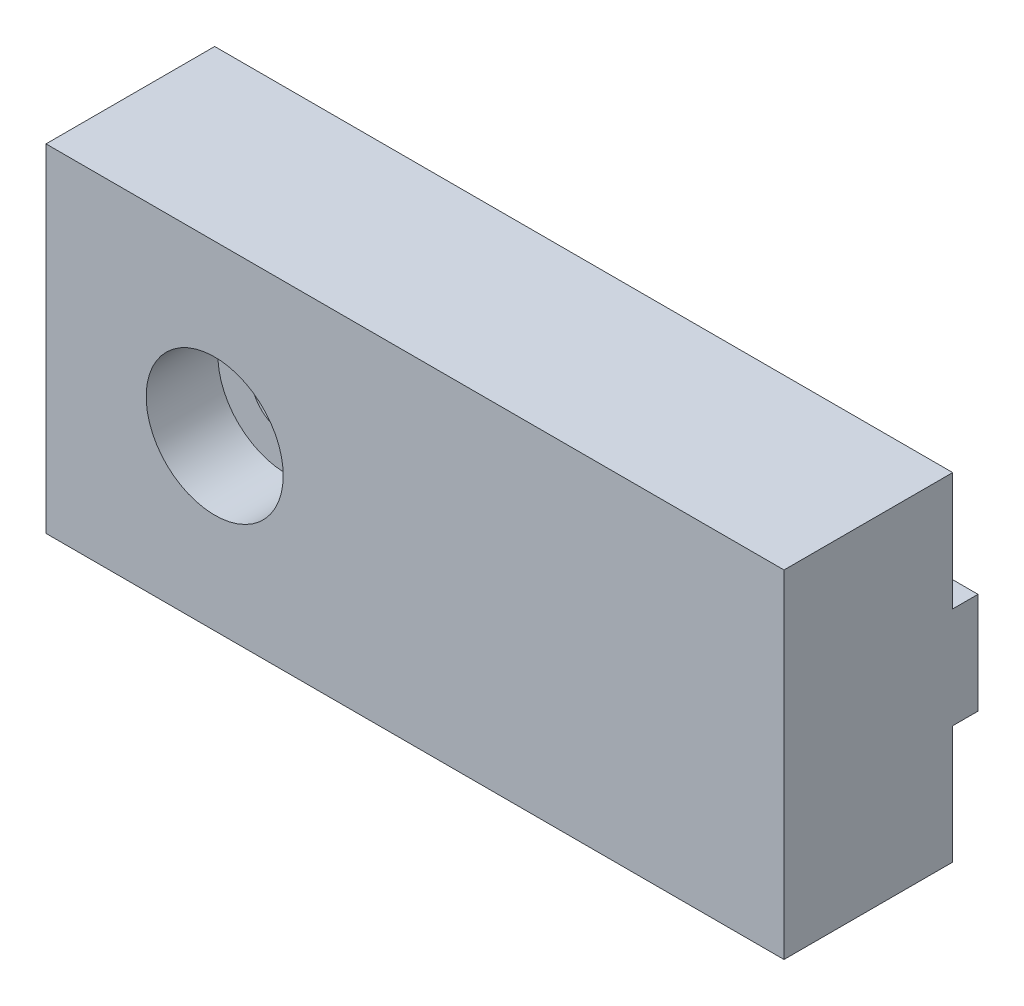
ISO-10303-21;
HEADER;
FILE_DESCRIPTION(('STEP AP214'),'2;1');
FILE_NAME('part.step','',(''),(''),'','','');
FILE_SCHEMA(('AUTOMOTIVE_DESIGN { 1 0 10303 214 1 1 1 1 }'));
ENDSEC;
DATA;
#1=APPLICATION_CONTEXT('core data for automotive mechanical design processes');
#2=APPLICATION_PROTOCOL_DEFINITION('international standard','automotive_design',2000,#1);
#3=PRODUCT_CONTEXT('',#1,'mechanical');
#4=PRODUCT('Part','Part','',(#3));
#5=PRODUCT_RELATED_PRODUCT_CATEGORY('part','',(#4));
#6=PRODUCT_DEFINITION_FORMATION('','',#4);
#7=PRODUCT_DEFINITION_CONTEXT('part definition',#1,'design');
#8=PRODUCT_DEFINITION('design','',#6,#7);
#9=PRODUCT_DEFINITION_SHAPE('','',#8);
#10=(LENGTH_UNIT() NAMED_UNIT(*) SI_UNIT(.MILLI.,.METRE.));
#11=(NAMED_UNIT(*) PLANE_ANGLE_UNIT() SI_UNIT($,.RADIAN.));
#12=(NAMED_UNIT(*) SI_UNIT($,.STERADIAN.) SOLID_ANGLE_UNIT());
#13=UNCERTAINTY_MEASURE_WITH_UNIT(LENGTH_MEASURE(1.E-05),#10,'distance_accuracy_value','');
#14=(GEOMETRIC_REPRESENTATION_CONTEXT(3) GLOBAL_UNCERTAINTY_ASSIGNED_CONTEXT((#13)) GLOBAL_UNIT_ASSIGNED_CONTEXT((#10,
#11,#12)) REPRESENTATION_CONTEXT('',''));
#15=CARTESIAN_POINT('',(0.,0.,0.));
#16=DIRECTION('',(0.,0.,1.));
#17=DIRECTION('',(1.,0.,0.));
#18=AXIS2_PLACEMENT_3D('',#15,#16,#17);
#19=CARTESIAN_POINT('',(0.,0.,0.));
#20=DIRECTION('',(0.,0.,-1.));
#21=DIRECTION('',(-1.,0.,0.));
#22=AXIS2_PLACEMENT_3D('',#19,#20,#21);
#23=PLANE('',#22);
#24=DIRECTION('',(1.,0.,0.));
#25=VECTOR('',#24,1.);
#26=CARTESIAN_POINT('',(17.5,2.4,0.));
#27=LINE('',#26,#25);
#28=CARTESIAN_POINT('',(-17.5,2.4,0.));
#29=VERTEX_POINT('',#28);
#30=CARTESIAN_POINT('',(17.5,2.4,0.));
#31=VERTEX_POINT('',#30);
#32=EDGE_CURVE('E50',#29,#31,#27,.T.);
#33=ORIENTED_EDGE('',*,*,#32,.F.);
#34=DIRECTION('',(0.,-1.,0.));
#35=VECTOR('',#34,1.);
#36=CARTESIAN_POINT('',(-17.5,-8.,0.));
#37=LINE('',#36,#35);
#38=CARTESIAN_POINT('',(-17.5,8.,0.));
#39=VERTEX_POINT('',#38);
#40=EDGE_CURVE('E144',#39,#29,#37,.T.);
#41=ORIENTED_EDGE('',*,*,#40,.F.);
#42=DIRECTION('',(-1.,0.,0.));
#43=VECTOR('',#42,1.);
#44=CARTESIAN_POINT('',(-17.5,8.,0.));
#45=LINE('',#44,#43);
#46=CARTESIAN_POINT('',(17.5,8.,0.));
#47=VERTEX_POINT('',#46);
#48=EDGE_CURVE('E141',#47,#39,#45,.T.);
#49=ORIENTED_EDGE('',*,*,#48,.F.);
#50=DIRECTION('',(0.,1.,0.));
#51=VECTOR('',#50,1.);
#52=CARTESIAN_POINT('',(17.5,-8.,0.));
#53=LINE('',#52,#51);
#54=EDGE_CURVE('E55',#31,#47,#53,.T.);
#55=ORIENTED_EDGE('',*,*,#54,.F.);
#56=EDGE_LOOP('',(#33,#41,#49,#55));
#57=FACE_BOUND('',#56,.T.);
#58=ADVANCED_FACE('F35',(#57),#23,.T.);
#59=CARTESIAN_POINT('',(17.5,-8.,8.));
#60=DIRECTION('',(-1.,0.,0.));
#61=DIRECTION('',(0.,0.,1.));
#62=AXIS2_PLACEMENT_3D('',#59,#60,#61);
#63=PLANE('',#62);
#64=CARTESIAN_POINT('',(17.5,-8.,0.));
#65=VERTEX_POINT('',#64);
#66=CARTESIAN_POINT('',(17.5,-2.4,0.));
#67=VERTEX_POINT('',#66);
#68=EDGE_CURVE('E123',#65,#67,#53,.T.);
#69=ORIENTED_EDGE('',*,*,#68,.T.);
#70=DIRECTION('',(0.,0.,1.));
#71=VECTOR('',#70,1.);
#72=CARTESIAN_POINT('',(17.5,-2.4,-1.2));
#73=LINE('',#72,#71);
#74=CARTESIAN_POINT('',(17.5,-2.4,-1.2));
#75=VERTEX_POINT('',#74);
#76=EDGE_CURVE('E104',#75,#67,#73,.T.);
#77=ORIENTED_EDGE('',*,*,#76,.F.);
#78=DIRECTION('',(0.,-1.,0.));
#79=VECTOR('',#78,1.);
#80=CARTESIAN_POINT('',(17.5,2.4,-1.2));
#81=LINE('',#80,#79);
#82=CARTESIAN_POINT('',(17.5,2.4,-1.2));
#83=VERTEX_POINT('',#82);
#84=EDGE_CURVE('E110',#83,#75,#81,.T.);
#85=ORIENTED_EDGE('',*,*,#84,.F.);
#86=DIRECTION('',(0.,0.,1.));
#87=VECTOR('',#86,1.);
#88=CARTESIAN_POINT('',(17.5,2.4,-1.2));
#89=LINE('',#88,#87);
#90=EDGE_CURVE('E162',#83,#31,#89,.T.);
#91=ORIENTED_EDGE('',*,*,#90,.T.);
#92=ORIENTED_EDGE('',*,*,#54,.T.);
#93=DIRECTION('',(0.,0.,-1.));
#94=VECTOR('',#93,1.);
#95=CARTESIAN_POINT('',(17.5,8.,8.));
#96=LINE('',#95,#94);
#97=CARTESIAN_POINT('',(17.5,8.,8.));
#98=VERTEX_POINT('',#97);
#99=EDGE_CURVE('E11',#98,#47,#96,.T.);
#100=ORIENTED_EDGE('',*,*,#99,.F.);
#101=DIRECTION('',(0.,1.,0.));
#102=VECTOR('',#101,1.);
#103=CARTESIAN_POINT('',(17.5,-8.,8.));
#104=LINE('',#103,#102);
#105=CARTESIAN_POINT('',(17.5,-8.,8.));
#106=VERTEX_POINT('',#105);
#107=EDGE_CURVE('E130',#106,#98,#104,.T.);
#108=ORIENTED_EDGE('',*,*,#107,.F.);
#109=DIRECTION('',(0.,0.,-1.));
#110=VECTOR('',#109,1.);
#111=CARTESIAN_POINT('',(17.5,-8.,8.));
#112=LINE('',#111,#110);
#113=EDGE_CURVE('E139',#106,#65,#112,.T.);
#114=ORIENTED_EDGE('',*,*,#113,.T.);
#115=EDGE_LOOP('',(#69,#77,#85,#91,#92,#100,#108,#114));
#116=FACE_BOUND('',#115,.T.);
#117=ADVANCED_FACE('F37',(#116),#63,.F.);
#118=CARTESIAN_POINT('',(-17.5,8.,8.));
#119=DIRECTION('',(0.,-1.,0.));
#120=DIRECTION('',(0.,0.,-1.));
#121=AXIS2_PLACEMENT_3D('',#118,#119,#120);
#122=PLANE('',#121);
#123=ORIENTED_EDGE('',*,*,#48,.T.);
#124=DIRECTION('',(0.,0.,-1.));
#125=VECTOR('',#124,1.);
#126=CARTESIAN_POINT('',(-17.5,8.,8.));
#127=LINE('',#126,#125);
#128=CARTESIAN_POINT('',(-17.5,8.,8.));
#129=VERTEX_POINT('',#128);
#130=EDGE_CURVE('E43',#129,#39,#127,.T.);
#131=ORIENTED_EDGE('',*,*,#130,.F.);
#132=DIRECTION('',(-1.,0.,0.));
#133=VECTOR('',#132,1.);
#134=CARTESIAN_POINT('',(-17.5,8.,8.));
#135=LINE('',#134,#133);
#136=EDGE_CURVE('E133',#98,#129,#135,.T.);
#137=ORIENTED_EDGE('',*,*,#136,.F.);
#138=ORIENTED_EDGE('',*,*,#99,.T.);
#139=EDGE_LOOP('',(#123,#131,#137,#138));
#140=FACE_BOUND('',#139,.T.);
#141=ADVANCED_FACE('F160',(#140),#122,.F.);
#142=CARTESIAN_POINT('',(-17.5,-8.,8.));
#143=DIRECTION('',(1.,0.,0.));
#144=DIRECTION('',(0.,0.,-1.));
#145=AXIS2_PLACEMENT_3D('',#142,#143,#144);
#146=PLANE('',#145);
#147=ORIENTED_EDGE('',*,*,#40,.T.);
#148=DIRECTION('',(0.,0.,1.));
#149=VECTOR('',#148,1.);
#150=CARTESIAN_POINT('',(-17.5,2.4,-1.2));
#151=LINE('',#150,#149);
#152=CARTESIAN_POINT('',(-17.5,2.4,-1.2));
#153=VERTEX_POINT('',#152);
#154=EDGE_CURVE('E126',#153,#29,#151,.T.);
#155=ORIENTED_EDGE('',*,*,#154,.F.);
#156=DIRECTION('',(0.,1.,0.));
#157=VECTOR('',#156,1.);
#158=CARTESIAN_POINT('',(-17.5,2.4,-1.2));
#159=LINE('',#158,#157);
#160=CARTESIAN_POINT('',(-17.5,-2.4,-1.2));
#161=VERTEX_POINT('',#160);
#162=EDGE_CURVE('E109',#161,#153,#159,.T.);
#163=ORIENTED_EDGE('',*,*,#162,.F.);
#164=DIRECTION('',(0.,0.,1.));
#165=VECTOR('',#164,1.);
#166=CARTESIAN_POINT('',(-17.5,-2.4,-1.2));
#167=LINE('',#166,#165);
#168=CARTESIAN_POINT('',(-17.5,-2.4,0.));
#169=VERTEX_POINT('',#168);
#170=EDGE_CURVE('E106',#161,#169,#167,.T.);
#171=ORIENTED_EDGE('',*,*,#170,.T.);
#172=CARTESIAN_POINT('',(-17.5,-8.,0.));
#173=VERTEX_POINT('',#172);
#174=EDGE_CURVE('E143',#169,#173,#37,.T.);
#175=ORIENTED_EDGE('',*,*,#174,.T.);
#176=DIRECTION('',(0.,0.,-1.));
#177=VECTOR('',#176,1.);
#178=CARTESIAN_POINT('',(-17.5,-8.,8.));
#179=LINE('',#178,#177);
#180=CARTESIAN_POINT('',(-17.5,-8.,8.));
#181=VERTEX_POINT('',#180);
#182=EDGE_CURVE('E148',#181,#173,#179,.T.);
#183=ORIENTED_EDGE('',*,*,#182,.F.);
#184=DIRECTION('',(0.,-1.,0.));
#185=VECTOR('',#184,1.);
#186=CARTESIAN_POINT('',(-17.5,-8.,8.));
#187=LINE('',#186,#185);
#188=EDGE_CURVE('E136',#129,#181,#187,.T.);
#189=ORIENTED_EDGE('',*,*,#188,.F.);
#190=ORIENTED_EDGE('',*,*,#130,.T.);
#191=EDGE_LOOP('',(#147,#155,#163,#171,#175,#183,#189,#190));
#192=FACE_BOUND('',#191,.T.);
#193=ADVANCED_FACE('F154',(#192),#146,.F.);
#194=CARTESIAN_POINT('',(-17.5,-8.,8.));
#195=DIRECTION('',(0.,1.,0.));
#196=DIRECTION('',(0.,0.,1.));
#197=AXIS2_PLACEMENT_3D('',#194,#195,#196);
#198=PLANE('',#197);
#199=DIRECTION('',(1.,0.,0.));
#200=VECTOR('',#199,1.);
#201=CARTESIAN_POINT('',(-17.5,-8.,0.));
#202=LINE('',#201,#200);
#203=EDGE_CURVE('E134',#173,#65,#202,.T.);
#204=ORIENTED_EDGE('',*,*,#203,.T.);
#205=ORIENTED_EDGE('',*,*,#113,.F.);
#206=DIRECTION('',(1.,0.,0.));
#207=VECTOR('',#206,1.);
#208=CARTESIAN_POINT('',(-17.5,-8.,8.));
#209=LINE('',#208,#207);
#210=EDGE_CURVE('E138',#181,#106,#209,.T.);
#211=ORIENTED_EDGE('',*,*,#210,.F.);
#212=ORIENTED_EDGE('',*,*,#182,.T.);
#213=EDGE_LOOP('',(#204,#205,#211,#212));
#214=FACE_BOUND('',#213,.T.);
#215=ADVANCED_FACE('F190',(#214),#198,.F.);
#216=CARTESIAN_POINT('',(0.,0.,8.));
#217=DIRECTION('',(0.,0.,-1.));
#218=DIRECTION('',(-1.,0.,0.));
#219=AXIS2_PLACEMENT_3D('',#216,#217,#218);
#220=PLANE('',#219);
#221=CARTESIAN_POINT('',(-9.50000000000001,0.,8.));
#222=DIRECTION('',(0.,0.,1.));
#223=DIRECTION('',(1.,0.,0.));
#224=AXIS2_PLACEMENT_3D('',#221,#222,#223);
#225=CIRCLE('',#224,3.25);
#226=CARTESIAN_POINT('',(-6.25000000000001,0.,8.));
#227=VERTEX_POINT('',#226);
#228=EDGE_CURVE('E180',#227,#227,#225,.T.);
#229=ORIENTED_EDGE('',*,*,#228,.F.);
#230=EDGE_LOOP('',(#229));
#231=FACE_BOUND('',#230,.T.);
#232=ORIENTED_EDGE('',*,*,#107,.T.);
#233=ORIENTED_EDGE('',*,*,#136,.T.);
#234=ORIENTED_EDGE('',*,*,#188,.T.);
#235=ORIENTED_EDGE('',*,*,#210,.T.);
#236=EDGE_LOOP('',(#232,#233,#234,#235));
#237=FACE_BOUND('',#236,.T.);
#238=ADVANCED_FACE('F186',(#231,#237),#220,.F.);
#239=DIRECTION('',(-1.,0.,0.));
#240=VECTOR('',#239,1.);
#241=CARTESIAN_POINT('',(17.5,-2.4,0.));
#242=LINE('',#241,#240);
#243=EDGE_CURVE('E168',#67,#169,#242,.T.);
#244=ORIENTED_EDGE('',*,*,#243,.F.);
#245=ORIENTED_EDGE('',*,*,#68,.F.);
#246=ORIENTED_EDGE('',*,*,#203,.F.);
#247=ORIENTED_EDGE('',*,*,#174,.F.);
#248=EDGE_LOOP('',(#244,#245,#246,#247));
#249=FACE_BOUND('',#248,.T.);
#250=ADVANCED_FACE('F189',(#249),#23,.T.);
#251=CARTESIAN_POINT('',(17.5,-2.4,-1.2));
#252=DIRECTION('',(0.,1.,0.));
#253=DIRECTION('',(-1.,0.,0.));
#254=AXIS2_PLACEMENT_3D('',#251,#252,#253);
#255=PLANE('',#254);
#256=ORIENTED_EDGE('',*,*,#243,.T.);
#257=ORIENTED_EDGE('',*,*,#170,.F.);
#258=DIRECTION('',(-1.,0.,0.));
#259=VECTOR('',#258,1.);
#260=CARTESIAN_POINT('',(17.5,-2.4,-1.2));
#261=LINE('',#260,#259);
#262=EDGE_CURVE('E99',#75,#161,#261,.T.);
#263=ORIENTED_EDGE('',*,*,#262,.F.);
#264=ORIENTED_EDGE('',*,*,#76,.T.);
#265=EDGE_LOOP('',(#256,#257,#263,#264));
#266=FACE_BOUND('',#265,.T.);
#267=ADVANCED_FACE('F102',(#266),#255,.F.);
#268=CARTESIAN_POINT('',(17.5,2.4,-1.2));
#269=DIRECTION('',(0.,-1.,0.));
#270=DIRECTION('',(1.,0.,0.));
#271=AXIS2_PLACEMENT_3D('',#268,#269,#270);
#272=PLANE('',#271);
#273=ORIENTED_EDGE('',*,*,#32,.T.);
#274=ORIENTED_EDGE('',*,*,#90,.F.);
#275=DIRECTION('',(1.,0.,0.));
#276=VECTOR('',#275,1.);
#277=CARTESIAN_POINT('',(17.5,2.4,-1.2));
#278=LINE('',#277,#276);
#279=EDGE_CURVE('E115',#153,#83,#278,.T.);
#280=ORIENTED_EDGE('',*,*,#279,.F.);
#281=ORIENTED_EDGE('',*,*,#154,.T.);
#282=EDGE_LOOP('',(#273,#274,#280,#281));
#283=FACE_BOUND('',#282,.T.);
#284=ADVANCED_FACE('F197',(#283),#272,.F.);
#285=CARTESIAN_POINT('',(0.,0.,-1.2));
#286=DIRECTION('',(0.,0.,-1.));
#287=DIRECTION('',(-1.,0.,0.));
#288=AXIS2_PLACEMENT_3D('',#285,#286,#287);
#289=PLANE('',#288);
#290=CARTESIAN_POINT('',(-9.50000000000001,0.,-1.2));
#291=DIRECTION('',(0.,0.,1.));
#292=DIRECTION('',(1.,0.,0.));
#293=AXIS2_PLACEMENT_3D('',#290,#291,#292);
#294=CIRCLE('',#293,1.7);
#295=CARTESIAN_POINT('',(-7.80000000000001,0.,-1.2));
#296=VERTEX_POINT('',#295);
#297=EDGE_CURVE('E169',#296,#296,#294,.T.);
#298=ORIENTED_EDGE('',*,*,#297,.T.);
#299=EDGE_LOOP('',(#298));
#300=FACE_BOUND('',#299,.T.);
#301=ORIENTED_EDGE('',*,*,#84,.T.);
#302=ORIENTED_EDGE('',*,*,#262,.T.);
#303=ORIENTED_EDGE('',*,*,#162,.T.);
#304=ORIENTED_EDGE('',*,*,#279,.T.);
#305=EDGE_LOOP('',(#301,#302,#303,#304));
#306=FACE_BOUND('',#305,.T.);
#307=ADVANCED_FACE('F113',(#300,#306),#289,.T.);
#308=CARTESIAN_POINT('',(-9.50000000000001,0.,8.));
#309=DIRECTION('',(0.,0.,1.));
#310=DIRECTION('',(1.,0.,0.));
#311=AXIS2_PLACEMENT_3D('',#308,#309,#310);
#312=CYLINDRICAL_SURFACE('',#311,1.7);
#313=ORIENTED_EDGE('',*,*,#297,.F.);
#314=EDGE_LOOP('',(#313));
#315=FACE_BOUND('',#314,.T.);
#316=CARTESIAN_POINT('',(-9.50000000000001,0.,4.6));
#317=DIRECTION('',(0.,0.,1.));
#318=DIRECTION('',(1.,0.,0.));
#319=AXIS2_PLACEMENT_3D('',#316,#317,#318);
#320=CIRCLE('',#319,1.7);
#321=CARTESIAN_POINT('',(-7.80000000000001,0.,4.6));
#322=VERTEX_POINT('',#321);
#323=EDGE_CURVE('E174',#322,#322,#320,.T.);
#324=ORIENTED_EDGE('',*,*,#323,.T.);
#325=EDGE_LOOP('',(#324));
#326=FACE_BOUND('',#325,.T.);
#327=ADVANCED_FACE('F204',(#315,#326),#312,.F.);
#328=CARTESIAN_POINT('',(-7.80000000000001,0.,4.6));
#329=DIRECTION('',(0.,0.,-1.));
#330=DIRECTION('',(-1.,0.,0.));
#331=AXIS2_PLACEMENT_3D('',#328,#329,#330);
#332=PLANE('',#331);
#333=ORIENTED_EDGE('',*,*,#323,.F.);
#334=EDGE_LOOP('',(#333));
#335=FACE_BOUND('',#334,.T.);
#336=CARTESIAN_POINT('',(-9.50000000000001,0.,4.6));
#337=DIRECTION('',(0.,0.,1.));
#338=DIRECTION('',(1.,0.,0.));
#339=AXIS2_PLACEMENT_3D('',#336,#337,#338);
#340=CIRCLE('',#339,3.25);
#341=CARTESIAN_POINT('',(-6.25000000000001,0.,4.6));
#342=VERTEX_POINT('',#341);
#343=EDGE_CURVE('E177',#342,#342,#340,.T.);
#344=ORIENTED_EDGE('',*,*,#343,.T.);
#345=EDGE_LOOP('',(#344));
#346=FACE_BOUND('',#345,.T.);
#347=ADVANCED_FACE('F250',(#335,#346),#332,.F.);
#348=CARTESIAN_POINT('',(-9.50000000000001,0.,8.));
#349=DIRECTION('',(0.,0.,1.));
#350=DIRECTION('',(1.,0.,0.));
#351=AXIS2_PLACEMENT_3D('',#348,#349,#350);
#352=CYLINDRICAL_SURFACE('',#351,3.25);
#353=ORIENTED_EDGE('',*,*,#343,.F.);
#354=EDGE_LOOP('',(#353));
#355=FACE_BOUND('',#354,.T.);
#356=ORIENTED_EDGE('',*,*,#228,.T.);
#357=EDGE_LOOP('',(#356));
#358=FACE_BOUND('',#357,.T.);
#359=ADVANCED_FACE('F184',(#355,#358),#352,.F.);
#360=CLOSED_SHELL('',(#58,#117,#141,#193,#215,#238,#250,#267,#284,#307,#327,#347,#359));
#361=MANIFOLD_SOLID_BREP('B2',#360);
#362=ADVANCED_BREP_SHAPE_REPRESENTATION('',(#18,#361),#14);
#363=SHAPE_DEFINITION_REPRESENTATION(#9,#362);
ENDSEC;
END-ISO-10303-21;
